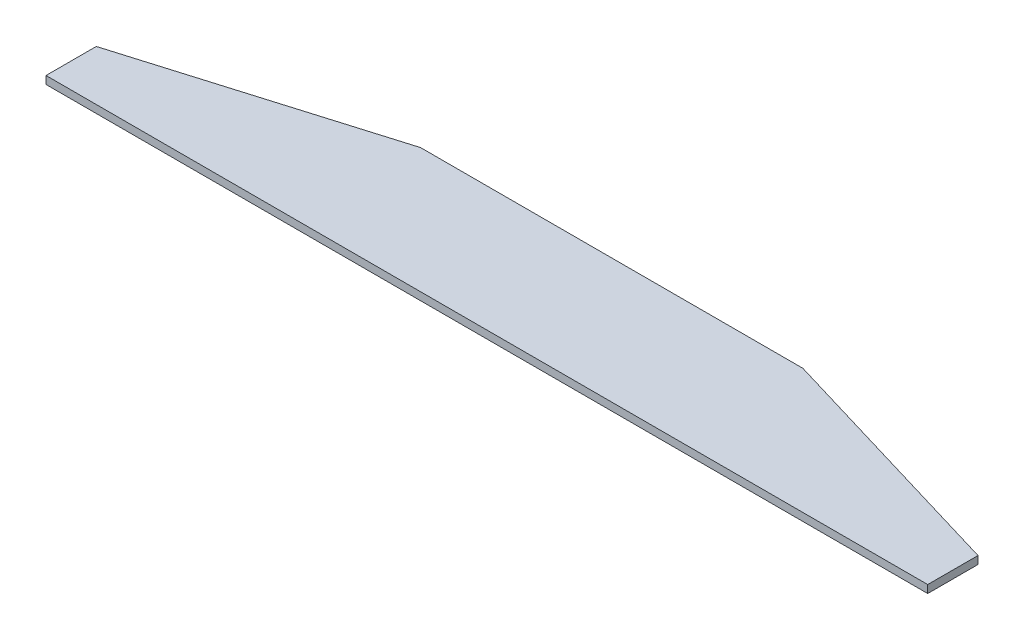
from build123d import *

# Parameters (mm, degrees)
EXTRUDE1_DEPTH = 6.35


with BuildPart() as part:
    # Sketch1 → Extrude1 (new body)
    with BuildSketch(Plane(origin=(0, 0, 0), x_dir=(1, 0, 0), z_dir=(0, 1, 0))):
        Polygon((717.55, 40.9194), (514.35, 101.6), (203.2, 101.6), (0, 40.9194), (0, 0), (717.55, 0), align=None)
    extrude(amount=EXTRUDE1_DEPTH)


solid = part.part
